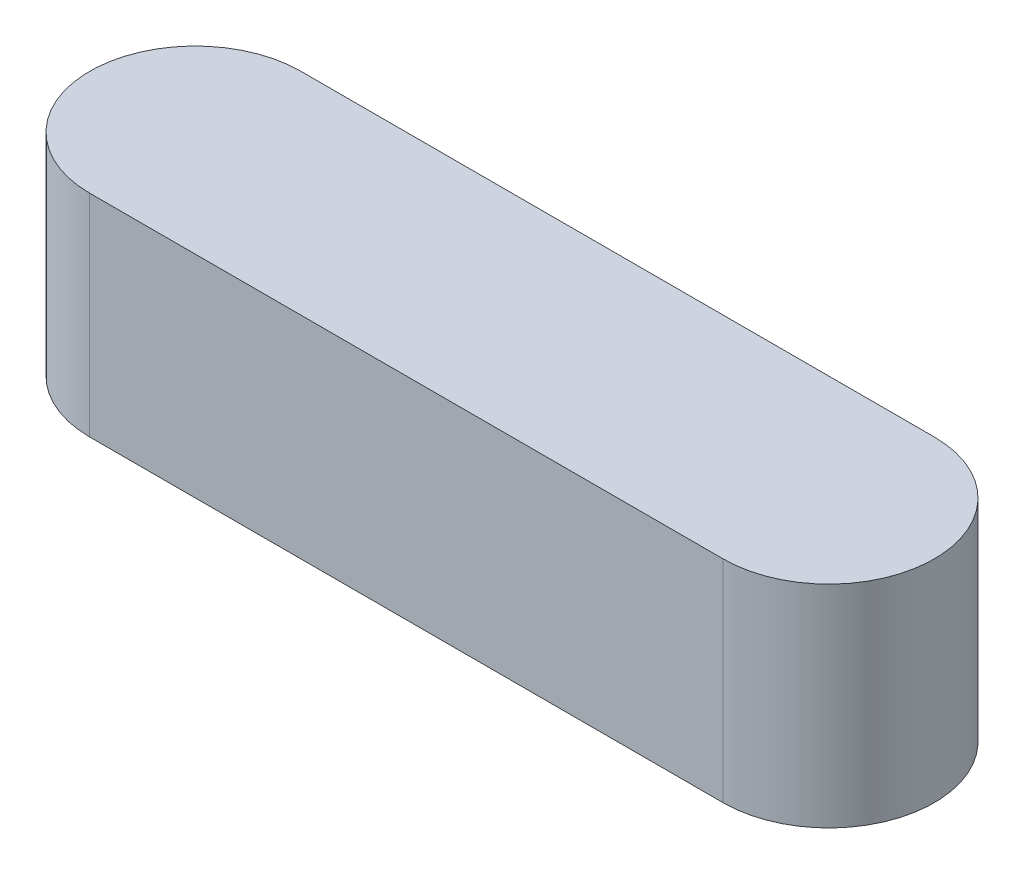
from build123d import *

# Parameters (mm, degrees)
BOSS_EXTRUDE1_DEPTH = 5


with BuildPart() as part:
    # Sketch1 → Boss-Extrude1 (new body)
    with BuildSketch(Plane(origin=(0, 0, 0), x_dir=(1, 0, 0), z_dir=(0, 1, 0))):
        with BuildLine():
            Line((0, 0), (15, 0))
            ThreePointArc((15, 0), (17.5, 2.5), (15, 5))
            Line((15, 5), (0, 5))
            ThreePointArc((0, 5), (-2.5, 2.5), (0, 0))
        make_face()
    extrude(amount=BOSS_EXTRUDE1_DEPTH)


solid = part.part
